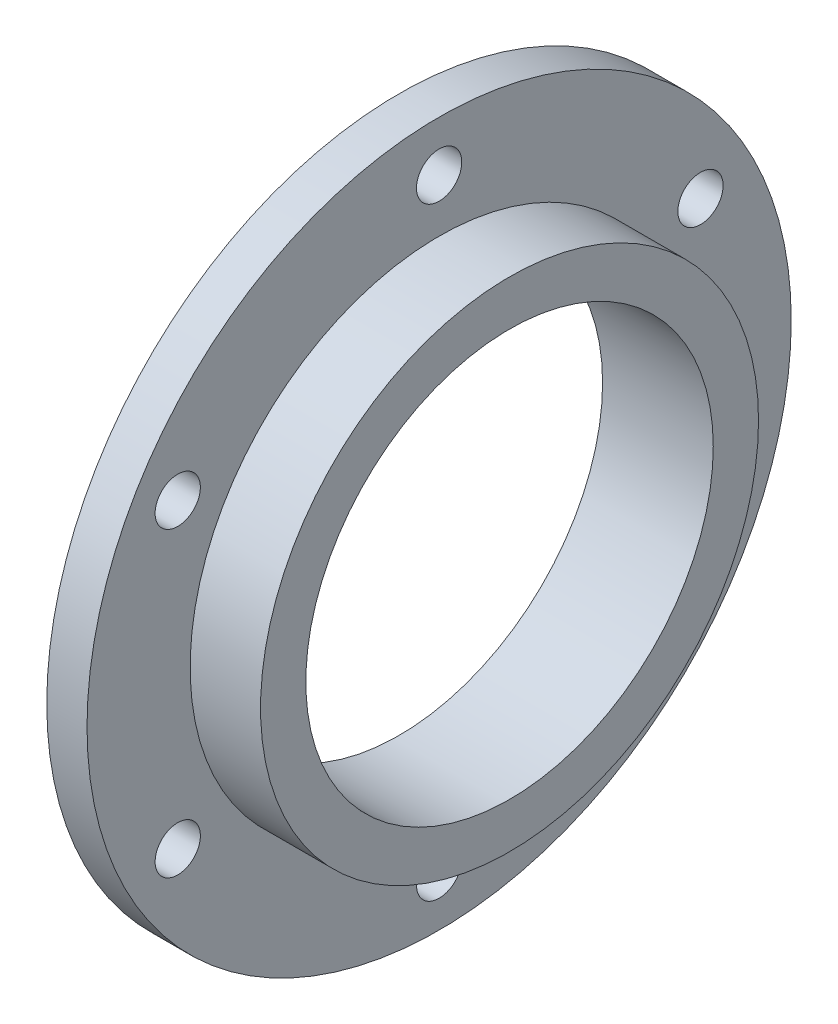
ISO-10303-21;
HEADER;
FILE_DESCRIPTION(('STEP AP214'),'2;1');
FILE_NAME('part.step','',(''),(''),'','','');
FILE_SCHEMA(('AUTOMOTIVE_DESIGN { 1 0 10303 214 1 1 1 1 }'));
ENDSEC;
DATA;
#1=APPLICATION_CONTEXT('core data for automotive mechanical design processes');
#2=APPLICATION_PROTOCOL_DEFINITION('international standard','automotive_design',2000,#1);
#3=PRODUCT_CONTEXT('',#1,'mechanical');
#4=PRODUCT('Part','Part','',(#3));
#5=PRODUCT_RELATED_PRODUCT_CATEGORY('part','',(#4));
#6=PRODUCT_DEFINITION_FORMATION('','',#4);
#7=PRODUCT_DEFINITION_CONTEXT('part definition',#1,'design');
#8=PRODUCT_DEFINITION('design','',#6,#7);
#9=PRODUCT_DEFINITION_SHAPE('','',#8);
#10=(LENGTH_UNIT() NAMED_UNIT(*) SI_UNIT(.MILLI.,.METRE.));
#11=(NAMED_UNIT(*) PLANE_ANGLE_UNIT() SI_UNIT($,.RADIAN.));
#12=(NAMED_UNIT(*) SI_UNIT($,.STERADIAN.) SOLID_ANGLE_UNIT());
#13=UNCERTAINTY_MEASURE_WITH_UNIT(LENGTH_MEASURE(1.E-05),#10,'distance_accuracy_value','');
#14=(GEOMETRIC_REPRESENTATION_CONTEXT(3) GLOBAL_UNCERTAINTY_ASSIGNED_CONTEXT((#13)) GLOBAL_UNIT_ASSIGNED_CONTEXT((#10,
#11,#12)) REPRESENTATION_CONTEXT('',''));
#15=CARTESIAN_POINT('',(0.,0.,0.));
#16=DIRECTION('',(0.,0.,1.));
#17=DIRECTION('',(1.,0.,0.));
#18=AXIS2_PLACEMENT_3D('',#15,#16,#17);
#19=CARTESIAN_POINT('',(-22.,40.5,0.));
#20=DIRECTION('',(-1.,0.,0.));
#21=DIRECTION('',(0.,0.,1.));
#22=AXIS2_PLACEMENT_3D('',#19,#20,#21);
#23=PLANE('',#22);
#24=CARTESIAN_POINT('',(-22.,-30.0000000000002,51.9615242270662));
#25=DIRECTION('',(-1.,0.,0.));
#26=DIRECTION('',(0.,-0.866025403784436,-0.500000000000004));
#27=AXIS2_PLACEMENT_3D('',#24,#25,#26);
#28=CIRCLE('',#27,4.5);
#29=CARTESIAN_POINT('',(-22.,-33.8971143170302,49.7115242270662));
#30=VERTEX_POINT('',#29);
#31=EDGE_CURVE('E59',#30,#30,#28,.T.);
#32=ORIENTED_EDGE('',*,*,#31,.F.);
#33=EDGE_LOOP('',(#32));
#34=FACE_BOUND('',#33,.T.);
#35=CARTESIAN_POINT('',(-22.,-60.,0.));
#36=DIRECTION('',(-1.,0.,0.));
#37=DIRECTION('',(0.,0.,-1.));
#38=AXIS2_PLACEMENT_3D('',#35,#36,#37);
#39=CIRCLE('',#38,4.5);
#40=CARTESIAN_POINT('',(-22.,-60.,-4.5));
#41=VERTEX_POINT('',#40);
#42=EDGE_CURVE('E113',#41,#41,#39,.T.);
#43=ORIENTED_EDGE('',*,*,#42,.F.);
#44=EDGE_LOOP('',(#43));
#45=FACE_BOUND('',#44,.T.);
#46=CARTESIAN_POINT('',(-22.,-29.9999999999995,-51.9615242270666));
#47=DIRECTION('',(-1.,0.,0.));
#48=DIRECTION('',(0.,0.866025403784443,-0.499999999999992));
#49=AXIS2_PLACEMENT_3D('',#46,#47,#48);
#50=CIRCLE('',#49,4.5);
#51=CARTESIAN_POINT('',(-22.,-26.1028856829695,-54.2115242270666));
#52=VERTEX_POINT('',#51);
#53=EDGE_CURVE('E117',#52,#52,#50,.T.);
#54=ORIENTED_EDGE('',*,*,#53,.F.);
#55=EDGE_LOOP('',(#54));
#56=FACE_BOUND('',#55,.T.);
#57=CARTESIAN_POINT('',(-22.,30.0000000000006,-51.961524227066));
#58=DIRECTION('',(-1.,0.,0.));
#59=DIRECTION('',(0.,0.866025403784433,0.50000000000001));
#60=AXIS2_PLACEMENT_3D('',#57,#58,#59);
#61=CIRCLE('',#60,4.5);
#62=CARTESIAN_POINT('',(-22.,33.8971143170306,-49.7115242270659));
#63=VERTEX_POINT('',#62);
#64=EDGE_CURVE('E74',#63,#63,#61,.T.);
#65=ORIENTED_EDGE('',*,*,#64,.F.);
#66=EDGE_LOOP('',(#65));
#67=FACE_BOUND('',#66,.T.);
#68=CARTESIAN_POINT('',(-22.,29.9999999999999,51.9615242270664));
#69=DIRECTION('',(-1.,0.,0.));
#70=DIRECTION('',(0.,-0.86602540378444,0.499999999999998));
#71=AXIS2_PLACEMENT_3D('',#68,#69,#70);
#72=CIRCLE('',#71,4.5);
#73=CARTESIAN_POINT('',(-22.,26.1028856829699,54.2115242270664));
#74=VERTEX_POINT('',#73);
#75=EDGE_CURVE('E54',#74,#74,#72,.T.);
#76=ORIENTED_EDGE('',*,*,#75,.F.);
#77=EDGE_LOOP('',(#76));
#78=FACE_BOUND('',#77,.T.);
#79=CARTESIAN_POINT('',(-22.,60.,0.));
#80=DIRECTION('',(-1.,0.,0.));
#81=DIRECTION('',(0.,0.,1.));
#82=AXIS2_PLACEMENT_3D('',#79,#80,#81);
#83=CIRCLE('',#82,4.5);
#84=CARTESIAN_POINT('',(-22.,60.,4.5));
#85=VERTEX_POINT('',#84);
#86=EDGE_CURVE('E50',#85,#85,#83,.T.);
#87=ORIENTED_EDGE('',*,*,#86,.F.);
#88=EDGE_LOOP('',(#87));
#89=FACE_BOUND('',#88,.T.);
#90=CARTESIAN_POINT('',(-22.,0.,0.));
#91=DIRECTION('',(1.,0.,0.));
#92=DIRECTION('',(0.,0.,-1.));
#93=AXIS2_PLACEMENT_3D('',#90,#91,#92);
#94=CIRCLE('',#93,40.5);
#95=CARTESIAN_POINT('',(-22.,0.,-40.5));
#96=VERTEX_POINT('',#95);
#97=EDGE_CURVE('E49',#96,#96,#94,.T.);
#98=ORIENTED_EDGE('',*,*,#97,.T.);
#99=EDGE_LOOP('',(#98));
#100=FACE_BOUND('',#99,.T.);
#101=CARTESIAN_POINT('',(-22.,0.,0.));
#102=DIRECTION('',(1.,0.,0.));
#103=DIRECTION('',(0.,0.,-1.));
#104=AXIS2_PLACEMENT_3D('',#101,#102,#103);
#105=CIRCLE('',#104,70.);
#106=CARTESIAN_POINT('',(-22.,0.,-70.));
#107=VERTEX_POINT('',#106);
#108=EDGE_CURVE('E10',#107,#107,#105,.T.);
#109=ORIENTED_EDGE('',*,*,#108,.F.);
#110=EDGE_LOOP('',(#109));
#111=FACE_BOUND('',#110,.T.);
#112=ADVANCED_FACE('F30',(#34,#45,#56,#67,#78,#89,#100,#111),#23,.T.);
#113=CARTESIAN_POINT('',(0.,0.,0.));
#114=DIRECTION('',(1.,0.,0.));
#115=DIRECTION('',(0.,0.,-1.));
#116=AXIS2_PLACEMENT_3D('',#113,#114,#115);
#117=CYLINDRICAL_SURFACE('',#116,70.);
#118=ORIENTED_EDGE('',*,*,#108,.T.);
#119=EDGE_LOOP('',(#118));
#120=FACE_BOUND('',#119,.T.);
#121=CARTESIAN_POINT('',(-14.,0.,0.));
#122=DIRECTION('',(1.,0.,0.));
#123=DIRECTION('',(0.,0.,-1.));
#124=AXIS2_PLACEMENT_3D('',#121,#122,#123);
#125=CIRCLE('',#124,70.);
#126=CARTESIAN_POINT('',(-14.,0.,-70.));
#127=VERTEX_POINT('',#126);
#128=EDGE_CURVE('E37',#127,#127,#125,.T.);
#129=ORIENTED_EDGE('',*,*,#128,.F.);
#130=EDGE_LOOP('',(#129));
#131=FACE_BOUND('',#130,.T.);
#132=ADVANCED_FACE('F93',(#120,#131),#117,.T.);
#133=CARTESIAN_POINT('',(-14.,70.,0.));
#134=DIRECTION('',(1.,0.,0.));
#135=DIRECTION('',(0.,0.,-1.));
#136=AXIS2_PLACEMENT_3D('',#133,#134,#135);
#137=PLANE('',#136);
#138=CARTESIAN_POINT('',(-14.,-30.0000000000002,51.9615242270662));
#139=DIRECTION('',(1.,0.,0.));
#140=DIRECTION('',(0.,0.,-1.));
#141=AXIS2_PLACEMENT_3D('',#138,#139,#140);
#142=CIRCLE('',#141,4.5);
#143=CARTESIAN_POINT('',(-14.,-30.0000000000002,47.4615242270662));
#144=VERTEX_POINT('',#143);
#145=EDGE_CURVE('E33',#144,#144,#142,.T.);
#146=ORIENTED_EDGE('',*,*,#145,.F.);
#147=EDGE_LOOP('',(#146));
#148=FACE_BOUND('',#147,.T.);
#149=CARTESIAN_POINT('',(-14.,-60.,0.));
#150=DIRECTION('',(1.,0.,0.));
#151=DIRECTION('',(0.,0.,-1.));
#152=AXIS2_PLACEMENT_3D('',#149,#150,#151);
#153=CIRCLE('',#152,4.5);
#154=CARTESIAN_POINT('',(-14.,-60.,-4.5));
#155=VERTEX_POINT('',#154);
#156=EDGE_CURVE('E61',#155,#155,#153,.T.);
#157=ORIENTED_EDGE('',*,*,#156,.F.);
#158=EDGE_LOOP('',(#157));
#159=FACE_BOUND('',#158,.T.);
#160=CARTESIAN_POINT('',(-14.,-29.9999999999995,-51.9615242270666));
#161=DIRECTION('',(1.,0.,0.));
#162=DIRECTION('',(0.,0.,-1.));
#163=AXIS2_PLACEMENT_3D('',#160,#161,#162);
#164=CIRCLE('',#163,4.5);
#165=CARTESIAN_POINT('',(-14.,-29.9999999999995,-56.4615242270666));
#166=VERTEX_POINT('',#165);
#167=EDGE_CURVE('E58',#166,#166,#164,.T.);
#168=ORIENTED_EDGE('',*,*,#167,.F.);
#169=EDGE_LOOP('',(#168));
#170=FACE_BOUND('',#169,.T.);
#171=CARTESIAN_POINT('',(-14.,30.0000000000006,-51.961524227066));
#172=DIRECTION('',(1.,0.,0.));
#173=DIRECTION('',(0.,0.,-1.));
#174=AXIS2_PLACEMENT_3D('',#171,#172,#173);
#175=CIRCLE('',#174,4.5);
#176=CARTESIAN_POINT('',(-14.,30.0000000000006,-56.461524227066));
#177=VERTEX_POINT('',#176);
#178=EDGE_CURVE('E55',#177,#177,#175,.T.);
#179=ORIENTED_EDGE('',*,*,#178,.F.);
#180=EDGE_LOOP('',(#179));
#181=FACE_BOUND('',#180,.T.);
#182=CARTESIAN_POINT('',(-14.,29.9999999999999,51.9615242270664));
#183=DIRECTION('',(1.,0.,0.));
#184=DIRECTION('',(0.,0.,-1.));
#185=AXIS2_PLACEMENT_3D('',#182,#183,#184);
#186=CIRCLE('',#185,4.5);
#187=CARTESIAN_POINT('',(-14.,29.9999999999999,47.4615242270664));
#188=VERTEX_POINT('',#187);
#189=EDGE_CURVE('E51',#188,#188,#186,.T.);
#190=ORIENTED_EDGE('',*,*,#189,.F.);
#191=EDGE_LOOP('',(#190));
#192=FACE_BOUND('',#191,.T.);
#193=CARTESIAN_POINT('',(-14.,60.,0.));
#194=DIRECTION('',(1.,0.,0.));
#195=DIRECTION('',(0.,0.,-1.));
#196=AXIS2_PLACEMENT_3D('',#193,#194,#195);
#197=CIRCLE('',#196,4.5);
#198=CARTESIAN_POINT('',(-14.,60.,-4.5));
#199=VERTEX_POINT('',#198);
#200=EDGE_CURVE('E46',#199,#199,#197,.T.);
#201=ORIENTED_EDGE('',*,*,#200,.F.);
#202=EDGE_LOOP('',(#201));
#203=FACE_BOUND('',#202,.T.);
#204=ORIENTED_EDGE('',*,*,#128,.T.);
#205=EDGE_LOOP('',(#204));
#206=FACE_BOUND('',#205,.T.);
#207=CARTESIAN_POINT('',(-14.,0.,0.));
#208=DIRECTION('',(1.,0.,0.));
#209=DIRECTION('',(0.,0.,-1.));
#210=AXIS2_PLACEMENT_3D('',#207,#208,#209);
#211=CIRCLE('',#210,49.5);
#212=CARTESIAN_POINT('',(-14.,0.,-49.5));
#213=VERTEX_POINT('',#212);
#214=EDGE_CURVE('E42',#213,#213,#211,.T.);
#215=ORIENTED_EDGE('',*,*,#214,.F.);
#216=EDGE_LOOP('',(#215));
#217=FACE_BOUND('',#216,.T.);
#218=ADVANCED_FACE('F91',(#148,#159,#170,#181,#192,#203,#206,#217),#137,.T.);
#219=CARTESIAN_POINT('',(0.,0.,0.));
#220=DIRECTION('',(1.,0.,0.));
#221=DIRECTION('',(0.,0.,-1.));
#222=AXIS2_PLACEMENT_3D('',#219,#220,#221);
#223=CYLINDRICAL_SURFACE('',#222,49.5);
#224=ORIENTED_EDGE('',*,*,#214,.T.);
#225=EDGE_LOOP('',(#224));
#226=FACE_BOUND('',#225,.T.);
#227=CARTESIAN_POINT('',(0.,0.,0.));
#228=DIRECTION('',(1.,0.,0.));
#229=DIRECTION('',(0.,0.,-1.));
#230=AXIS2_PLACEMENT_3D('',#227,#228,#229);
#231=CIRCLE('',#230,49.5);
#232=CARTESIAN_POINT('',(0.,0.,-49.5));
#233=VERTEX_POINT('',#232);
#234=EDGE_CURVE('E83',#233,#233,#231,.T.);
#235=ORIENTED_EDGE('',*,*,#234,.F.);
#236=EDGE_LOOP('',(#235));
#237=FACE_BOUND('',#236,.T.);
#238=ADVANCED_FACE('F88',(#226,#237),#223,.T.);
#239=CARTESIAN_POINT('',(0.,49.5,0.));
#240=DIRECTION('',(1.,0.,0.));
#241=DIRECTION('',(0.,0.,-1.));
#242=AXIS2_PLACEMENT_3D('',#239,#240,#241);
#243=PLANE('',#242);
#244=ORIENTED_EDGE('',*,*,#234,.T.);
#245=EDGE_LOOP('',(#244));
#246=FACE_BOUND('',#245,.T.);
#247=CARTESIAN_POINT('',(0.,0.,0.));
#248=DIRECTION('',(1.,0.,0.));
#249=DIRECTION('',(0.,0.,-1.));
#250=AXIS2_PLACEMENT_3D('',#247,#248,#249);
#251=CIRCLE('',#250,40.5);
#252=CARTESIAN_POINT('',(0.,0.,-40.5));
#253=VERTEX_POINT('',#252);
#254=EDGE_CURVE('E80',#253,#253,#251,.T.);
#255=ORIENTED_EDGE('',*,*,#254,.F.);
#256=EDGE_LOOP('',(#255));
#257=FACE_BOUND('',#256,.T.);
#258=ADVANCED_FACE('F100',(#246,#257),#243,.T.);
#259=CARTESIAN_POINT('',(0.,0.,0.));
#260=DIRECTION('',(1.,0.,0.));
#261=DIRECTION('',(0.,0.,-1.));
#262=AXIS2_PLACEMENT_3D('',#259,#260,#261);
#263=CYLINDRICAL_SURFACE('',#262,40.5);
#264=ORIENTED_EDGE('',*,*,#254,.T.);
#265=EDGE_LOOP('',(#264));
#266=FACE_BOUND('',#265,.T.);
#267=ORIENTED_EDGE('',*,*,#97,.F.);
#268=EDGE_LOOP('',(#267));
#269=FACE_BOUND('',#268,.T.);
#270=ADVANCED_FACE('F127',(#266,#269),#263,.F.);
#271=CARTESIAN_POINT('',(-12.,60.,0.));
#272=DIRECTION('',(-1.,0.,0.));
#273=DIRECTION('',(0.,0.,1.));
#274=AXIS2_PLACEMENT_3D('',#271,#272,#273);
#275=CYLINDRICAL_SURFACE('',#274,4.5);
#276=ORIENTED_EDGE('',*,*,#200,.T.);
#277=EDGE_LOOP('',(#276));
#278=FACE_BOUND('',#277,.T.);
#279=ORIENTED_EDGE('',*,*,#86,.T.);
#280=EDGE_LOOP('',(#279));
#281=FACE_BOUND('',#280,.T.);
#282=ADVANCED_FACE('F129',(#278,#281),#275,.F.);
#283=CARTESIAN_POINT('',(-12.,29.9999999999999,51.9615242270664));
#284=DIRECTION('',(-1.,0.,0.));
#285=DIRECTION('',(0.,0.,1.));
#286=AXIS2_PLACEMENT_3D('',#283,#284,#285);
#287=CYLINDRICAL_SURFACE('',#286,4.5);
#288=ORIENTED_EDGE('',*,*,#189,.T.);
#289=EDGE_LOOP('',(#288));
#290=FACE_BOUND('',#289,.T.);
#291=ORIENTED_EDGE('',*,*,#75,.T.);
#292=EDGE_LOOP('',(#291));
#293=FACE_BOUND('',#292,.T.);
#294=ADVANCED_FACE('F136',(#290,#293),#287,.F.);
#295=CARTESIAN_POINT('',(-12.,30.0000000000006,-51.961524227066));
#296=DIRECTION('',(-1.,0.,0.));
#297=DIRECTION('',(0.,0.,1.));
#298=AXIS2_PLACEMENT_3D('',#295,#296,#297);
#299=CYLINDRICAL_SURFACE('',#298,4.5);
#300=ORIENTED_EDGE('',*,*,#178,.T.);
#301=EDGE_LOOP('',(#300));
#302=FACE_BOUND('',#301,.T.);
#303=ORIENTED_EDGE('',*,*,#64,.T.);
#304=EDGE_LOOP('',(#303));
#305=FACE_BOUND('',#304,.T.);
#306=ADVANCED_FACE('F144',(#302,#305),#299,.F.);
#307=CARTESIAN_POINT('',(-12.,-29.9999999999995,-51.9615242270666));
#308=DIRECTION('',(-1.,0.,0.));
#309=DIRECTION('',(0.,0.,1.));
#310=AXIS2_PLACEMENT_3D('',#307,#308,#309);
#311=CYLINDRICAL_SURFACE('',#310,4.5);
#312=ORIENTED_EDGE('',*,*,#167,.T.);
#313=EDGE_LOOP('',(#312));
#314=FACE_BOUND('',#313,.T.);
#315=ORIENTED_EDGE('',*,*,#53,.T.);
#316=EDGE_LOOP('',(#315));
#317=FACE_BOUND('',#316,.T.);
#318=ADVANCED_FACE('F148',(#314,#317),#311,.F.);
#319=CARTESIAN_POINT('',(-12.,-60.,0.));
#320=DIRECTION('',(-1.,0.,0.));
#321=DIRECTION('',(0.,0.,1.));
#322=AXIS2_PLACEMENT_3D('',#319,#320,#321);
#323=CYLINDRICAL_SURFACE('',#322,4.5);
#324=ORIENTED_EDGE('',*,*,#156,.T.);
#325=EDGE_LOOP('',(#324));
#326=FACE_BOUND('',#325,.T.);
#327=ORIENTED_EDGE('',*,*,#42,.T.);
#328=EDGE_LOOP('',(#327));
#329=FACE_BOUND('',#328,.T.);
#330=ADVANCED_FACE('F152',(#326,#329),#323,.F.);
#331=CARTESIAN_POINT('',(-12.,-30.0000000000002,51.9615242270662));
#332=DIRECTION('',(-1.,0.,0.));
#333=DIRECTION('',(0.,0.,1.));
#334=AXIS2_PLACEMENT_3D('',#331,#332,#333);
#335=CYLINDRICAL_SURFACE('',#334,4.5);
#336=ORIENTED_EDGE('',*,*,#145,.T.);
#337=EDGE_LOOP('',(#336));
#338=FACE_BOUND('',#337,.T.);
#339=ORIENTED_EDGE('',*,*,#31,.T.);
#340=EDGE_LOOP('',(#339));
#341=FACE_BOUND('',#340,.T.);
#342=ADVANCED_FACE('F156',(#338,#341),#335,.F.);
#343=CLOSED_SHELL('',(#112,#132,#218,#238,#258,#270,#282,#294,#306,#318,#330,#342));
#344=MANIFOLD_SOLID_BREP('B2',#343);
#345=ADVANCED_BREP_SHAPE_REPRESENTATION('',(#18,#344),#14);
#346=SHAPE_DEFINITION_REPRESENTATION(#9,#345);
ENDSEC;
END-ISO-10303-21;
